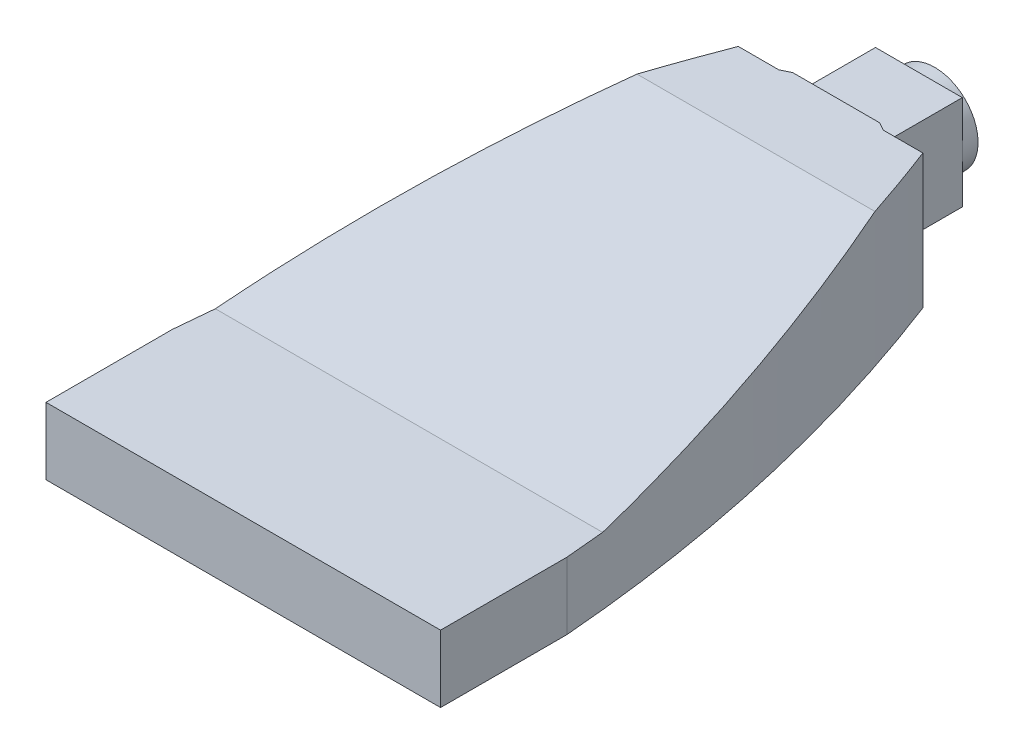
ISO-10303-21;
HEADER;
FILE_DESCRIPTION(('STEP AP214'),'2;1');
FILE_NAME('part.step','',(''),(''),'','','');
FILE_SCHEMA(('AUTOMOTIVE_DESIGN { 1 0 10303 214 1 1 1 1 }'));
ENDSEC;
DATA;
#1=APPLICATION_CONTEXT('core data for automotive mechanical design processes');
#2=APPLICATION_PROTOCOL_DEFINITION('international standard','automotive_design',2000,#1);
#3=PRODUCT_CONTEXT('',#1,'mechanical');
#4=PRODUCT('Part','Part','',(#3));
#5=PRODUCT_RELATED_PRODUCT_CATEGORY('part','',(#4));
#6=PRODUCT_DEFINITION_FORMATION('','',#4);
#7=PRODUCT_DEFINITION_CONTEXT('part definition',#1,'design');
#8=PRODUCT_DEFINITION('design','',#6,#7);
#9=PRODUCT_DEFINITION_SHAPE('','',#8);
#10=(LENGTH_UNIT() NAMED_UNIT(*) SI_UNIT(.MILLI.,.METRE.));
#11=(NAMED_UNIT(*) PLANE_ANGLE_UNIT() SI_UNIT($,.RADIAN.));
#12=(NAMED_UNIT(*) SI_UNIT($,.STERADIAN.) SOLID_ANGLE_UNIT());
#13=UNCERTAINTY_MEASURE_WITH_UNIT(LENGTH_MEASURE(1.E-05),#10,'distance_accuracy_value','');
#14=(GEOMETRIC_REPRESENTATION_CONTEXT(3) GLOBAL_UNCERTAINTY_ASSIGNED_CONTEXT((#13)) GLOBAL_UNIT_ASSIGNED_CONTEXT((#10,
#11,#12)) REPRESENTATION_CONTEXT('',''));
#15=CARTESIAN_POINT('',(0.,0.,0.));
#16=DIRECTION('',(0.,0.,1.));
#17=DIRECTION('',(1.,0.,0.));
#18=AXIS2_PLACEMENT_3D('',#15,#16,#17);
#19=CARTESIAN_POINT('',(0.,17.,-61.559315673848));
#20=DIRECTION('',(0.,0.,1.));
#21=DIRECTION('',(1.,0.,0.));
#22=AXIS2_PLACEMENT_3D('',#19,#20,#21);
#23=PLANE('',#22);
#24=CARTESIAN_POINT('',(-0.384535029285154,8.57674872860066,-61.559315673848));
#25=DIRECTION('',(0.,0.,-1.));
#26=DIRECTION('',(-1.,0.,0.));
#27=AXIS2_PLACEMENT_3D('',#24,#25,#26);
#28=CIRCLE('',#27,5.5);
#29=CARTESIAN_POINT('',(-5.88453502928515,8.57674872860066,-61.559315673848));
#30=VERTEX_POINT('',#29);
#31=CARTESIAN_POINT('',(5.11546497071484,8.57674872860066,-61.559315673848));
#32=VERTEX_POINT('',#31);
#33=EDGE_CURVE('E46',#30,#32,#28,.T.);
#34=ORIENTED_EDGE('',*,*,#33,.F.);
#35=DIRECTION('',(0.,-1.,0.));
#36=VECTOR('',#35,1.);
#37=CARTESIAN_POINT('',(-5.88453502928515,17.,-61.559315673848));
#38=LINE('',#37,#36);
#39=CARTESIAN_POINT('',(-5.88453502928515,14.5,-61.559315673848));
#40=VERTEX_POINT('',#39);
#41=EDGE_CURVE('E158',#40,#30,#38,.T.);
#42=ORIENTED_EDGE('',*,*,#41,.F.);
#43=DIRECTION('',(-1.,0.,0.));
#44=VECTOR('',#43,1.);
#45=CARTESIAN_POINT('',(5.11546497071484,14.5,-61.559315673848));
#46=LINE('',#45,#44);
#47=CARTESIAN_POINT('',(5.11546497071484,14.5,-61.559315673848));
#48=VERTEX_POINT('',#47);
#49=EDGE_CURVE('E641',#48,#40,#46,.T.);
#50=ORIENTED_EDGE('',*,*,#49,.F.);
#51=DIRECTION('',(0.,-1.,0.));
#52=VECTOR('',#51,1.);
#53=CARTESIAN_POINT('',(5.11546497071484,17.,-61.559315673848));
#54=LINE('',#53,#52);
#55=EDGE_CURVE('E179',#48,#32,#54,.T.);
#56=ORIENTED_EDGE('',*,*,#55,.T.);
#57=EDGE_LOOP('',(#34,#42,#50,#56));
#58=FACE_BOUND('',#57,.T.);
#59=ADVANCED_FACE('F35',(#58),#23,.F.);
#60=EDGE_CURVE('E11',#32,#30,#28,.T.);
#61=ORIENTED_EDGE('',*,*,#60,.F.);
#62=CARTESIAN_POINT('',(5.11546497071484,2.5,-61.559315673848));
#63=VERTEX_POINT('',#62);
#64=EDGE_CURVE('E169',#32,#63,#54,.T.);
#65=ORIENTED_EDGE('',*,*,#64,.T.);
#66=DIRECTION('',(-1.,0.,0.));
#67=VECTOR('',#66,1.);
#68=CARTESIAN_POINT('',(5.11546497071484,2.5,-61.559315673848));
#69=LINE('',#68,#67);
#70=CARTESIAN_POINT('',(-5.88453502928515,2.5,-61.559315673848));
#71=VERTEX_POINT('',#70);
#72=EDGE_CURVE('E174',#63,#71,#69,.T.);
#73=ORIENTED_EDGE('',*,*,#72,.T.);
#74=EDGE_CURVE('E162',#30,#71,#38,.T.);
#75=ORIENTED_EDGE('',*,*,#74,.F.);
#76=EDGE_LOOP('',(#61,#65,#73,#75));
#77=FACE_BOUND('',#76,.T.);
#78=ADVANCED_FACE('F172',(#77),#23,.F.);
#79=CARTESIAN_POINT('',(0.,17.,-50.4823249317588));
#80=DIRECTION('',(0.,0.,-1.));
#81=DIRECTION('',(-1.,0.,0.));
#82=AXIS2_PLACEMENT_3D('',#79,#80,#81);
#83=PLANE('',#82);
#84=DIRECTION('',(0.,-1.,0.));
#85=VECTOR('',#84,1.);
#86=CARTESIAN_POINT('',(6.19638247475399,17.,-50.4823249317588));
#87=LINE('',#86,#85);
#88=CARTESIAN_POINT('',(6.19638247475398,17.,-50.4823249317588));
#89=VERTEX_POINT('',#88);
#90=CARTESIAN_POINT('',(6.19638247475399,0.,-50.4823249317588));
#91=VERTEX_POINT('',#90);
#92=EDGE_CURVE('E231',#89,#91,#87,.T.);
#93=ORIENTED_EDGE('',*,*,#92,.F.);
#94=DIRECTION('',(-1.,0.,0.));
#95=VECTOR('',#94,1.);
#96=CARTESIAN_POINT('',(0.,17.,-50.4823249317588));
#97=LINE('',#96,#95);
#98=CARTESIAN_POINT('',(11.1947023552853,17.,-50.4823249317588));
#99=VERTEX_POINT('',#98);
#100=EDGE_CURVE('E292',#99,#89,#97,.T.);
#101=ORIENTED_EDGE('',*,*,#100,.F.);
#102=DIRECTION('',(0.,-1.,0.));
#103=VECTOR('',#102,1.);
#104=CARTESIAN_POINT('',(11.1947023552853,17.,-50.4823249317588));
#105=LINE('',#104,#103);
#106=CARTESIAN_POINT('',(11.1947023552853,0.,-50.4823249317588));
#107=VERTEX_POINT('',#106);
#108=EDGE_CURVE('E59',#99,#107,#105,.T.);
#109=ORIENTED_EDGE('',*,*,#108,.T.);
#110=DIRECTION('',(1.,0.,0.));
#111=VECTOR('',#110,1.);
#112=CARTESIAN_POINT('',(0.,0.,-50.4823249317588));
#113=LINE('',#112,#111);
#114=EDGE_CURVE('E363',#91,#107,#113,.T.);
#115=ORIENTED_EDGE('',*,*,#114,.F.);
#116=EDGE_LOOP('',(#93,#101,#109,#115));
#117=FACE_BOUND('',#116,.T.);
#118=ADVANCED_FACE('F37',(#117),#83,.T.);
#119=CARTESIAN_POINT('',(22.3457359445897,17.,-41.8618451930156));
#120=DIRECTION('',(0.470906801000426,0.,-0.882182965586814));
#121=DIRECTION('',(-0.882182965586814,0.,-0.470906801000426));
#122=AXIS2_PLACEMENT_3D('',#119,#120,#121);
#123=PLANE('',#122);
#124=DIRECTION('',(0.,-1.,0.));
#125=VECTOR('',#124,1.);
#126=CARTESIAN_POINT('',(5.11546497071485,17.,-51.059315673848));
#127=LINE('',#126,#125);
#128=CARTESIAN_POINT('',(5.11546497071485,17.,-51.059315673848));
#129=VERTEX_POINT('',#128);
#130=CARTESIAN_POINT('',(5.11546497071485,14.5,-51.059315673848));
#131=VERTEX_POINT('',#130);
#132=EDGE_CURVE('E223',#129,#131,#127,.T.);
#133=ORIENTED_EDGE('',*,*,#132,.F.);
#134=DIRECTION('',(-0.882182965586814,0.,-0.470906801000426));
#135=VECTOR('',#134,1.);
#136=CARTESIAN_POINT('',(22.3457359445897,17.,-41.8618451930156));
#137=LINE('',#136,#135);
#138=EDGE_CURVE('E225',#89,#129,#137,.T.);
#139=ORIENTED_EDGE('',*,*,#138,.F.);
#140=ORIENTED_EDGE('',*,*,#92,.T.);
#141=DIRECTION('',(0.882182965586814,0.,0.470906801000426));
#142=VECTOR('',#141,1.);
#143=CARTESIAN_POINT('',(22.3457359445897,0.,-41.8618451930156));
#144=LINE('',#143,#142);
#145=CARTESIAN_POINT('',(5.11546497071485,0.,-51.059315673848));
#146=VERTEX_POINT('',#145);
#147=EDGE_CURVE('E359',#146,#91,#144,.T.);
#148=ORIENTED_EDGE('',*,*,#147,.F.);
#149=DIRECTION('',(0.,1.,0.));
#150=VECTOR('',#149,1.);
#151=CARTESIAN_POINT('',(5.11546497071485,0.,-51.059315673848));
#152=LINE('',#151,#150);
#153=CARTESIAN_POINT('',(5.11546497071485,2.5,-51.059315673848));
#154=VERTEX_POINT('',#153);
#155=EDGE_CURVE('E281',#146,#154,#152,.T.);
#156=ORIENTED_EDGE('',*,*,#155,.T.);
#157=EDGE_CURVE('E228',#131,#154,#127,.T.);
#158=ORIENTED_EDGE('',*,*,#157,.F.);
#159=EDGE_LOOP('',(#133,#139,#140,#148,#156,#158));
#160=FACE_BOUND('',#159,.T.);
#161=ADVANCED_FACE('F210',(#160),#123,.T.);
#162=CARTESIAN_POINT('',(5.11546497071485,17.,0.));
#163=DIRECTION('',(-1.,0.,0.));
#164=DIRECTION('',(0.,0.,1.));
#165=AXIS2_PLACEMENT_3D('',#162,#163,#164);
#166=PLANE('',#165);
#167=ORIENTED_EDGE('',*,*,#55,.F.);
#168=DIRECTION('',(0.,0.,1.));
#169=VECTOR('',#168,1.);
#170=CARTESIAN_POINT('',(5.11546497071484,14.5,-61.559315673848));
#171=LINE('',#170,#169);
#172=EDGE_CURVE('E646',#48,#131,#171,.T.);
#173=ORIENTED_EDGE('',*,*,#172,.T.);
#174=ORIENTED_EDGE('',*,*,#157,.T.);
#175=DIRECTION('',(0.,0.,-1.));
#176=VECTOR('',#175,1.);
#177=CARTESIAN_POINT('',(5.11546497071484,2.5,-61.559315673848));
#178=LINE('',#177,#176);
#179=EDGE_CURVE('E273',#154,#63,#178,.T.);
#180=ORIENTED_EDGE('',*,*,#179,.T.);
#181=ORIENTED_EDGE('',*,*,#64,.F.);
#182=EDGE_LOOP('',(#167,#173,#174,#180,#181));
#183=FACE_BOUND('',#182,.T.);
#184=ADVANCED_FACE('F208',(#183),#166,.F.);
#185=CARTESIAN_POINT('',(-5.88453502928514,17.,0.));
#186=DIRECTION('',(1.,0.,0.));
#187=DIRECTION('',(0.,0.,-1.));
#188=AXIS2_PLACEMENT_3D('',#185,#186,#187);
#189=PLANE('',#188);
#190=DIRECTION('',(0.,-1.,0.));
#191=VECTOR('',#190,1.);
#192=CARTESIAN_POINT('',(-5.88453502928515,17.,-51.059315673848));
#193=LINE('',#192,#191);
#194=CARTESIAN_POINT('',(-5.88453502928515,14.5,-51.059315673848));
#195=VERTEX_POINT('',#194);
#196=CARTESIAN_POINT('',(-5.88453502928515,2.5,-51.059315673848));
#197=VERTEX_POINT('',#196);
#198=EDGE_CURVE('E255',#195,#197,#193,.T.);
#199=ORIENTED_EDGE('',*,*,#198,.F.);
#200=DIRECTION('',(0.,0.,1.));
#201=VECTOR('',#200,1.);
#202=CARTESIAN_POINT('',(-5.88453502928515,14.5,-61.559315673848));
#203=LINE('',#202,#201);
#204=EDGE_CURVE('E165',#40,#195,#203,.T.);
#205=ORIENTED_EDGE('',*,*,#204,.F.);
#206=ORIENTED_EDGE('',*,*,#41,.T.);
#207=ORIENTED_EDGE('',*,*,#74,.T.);
#208=DIRECTION('',(0.,0.,-1.));
#209=VECTOR('',#208,1.);
#210=CARTESIAN_POINT('',(-5.88453502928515,2.5,-61.559315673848));
#211=LINE('',#210,#209);
#212=EDGE_CURVE('E271',#197,#71,#211,.T.);
#213=ORIENTED_EDGE('',*,*,#212,.F.);
#214=EDGE_LOOP('',(#199,#205,#206,#207,#213));
#215=FACE_BOUND('',#214,.T.);
#216=ADVANCED_FACE('F160',(#215),#189,.F.);
#217=CARTESIAN_POINT('',(-21.3866147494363,17.,-43.4245292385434));
#218=DIRECTION('',(0.441823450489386,0.,0.897102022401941));
#219=DIRECTION('',(0.897102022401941,0.,-0.441823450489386));
#220=AXIS2_PLACEMENT_3D('',#217,#218,#219);
#221=PLANE('',#220);
#222=DIRECTION('',(-0.897102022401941,0.,0.441823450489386));
#223=VECTOR('',#222,1.);
#224=CARTESIAN_POINT('',(-21.3866147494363,17.,-43.4245292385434));
#225=LINE('',#224,#223);
#226=CARTESIAN_POINT('',(-5.88453502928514,17.,-51.059315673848));
#227=VERTEX_POINT('',#226);
#228=CARTESIAN_POINT('',(-7.05608796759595,17.,-50.4823249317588));
#229=VERTEX_POINT('',#228);
#230=EDGE_CURVE('E298',#227,#229,#225,.T.);
#231=ORIENTED_EDGE('',*,*,#230,.F.);
#232=EDGE_CURVE('E175',#227,#195,#193,.T.);
#233=ORIENTED_EDGE('',*,*,#232,.T.);
#234=ORIENTED_EDGE('',*,*,#198,.T.);
#235=DIRECTION('',(0.,1.,0.));
#236=VECTOR('',#235,1.);
#237=CARTESIAN_POINT('',(-5.88453502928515,0.,-51.059315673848));
#238=LINE('',#237,#236);
#239=CARTESIAN_POINT('',(-5.88453502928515,0.,-51.059315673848));
#240=VERTEX_POINT('',#239);
#241=EDGE_CURVE('E264',#240,#197,#238,.T.);
#242=ORIENTED_EDGE('',*,*,#241,.F.);
#243=DIRECTION('',(-0.897102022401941,0.,0.441823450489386));
#244=VECTOR('',#243,1.);
#245=CARTESIAN_POINT('',(-21.3866147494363,0.,-43.4245292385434));
#246=LINE('',#245,#244);
#247=CARTESIAN_POINT('',(-7.05608796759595,0.,-50.4823249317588));
#248=VERTEX_POINT('',#247);
#249=EDGE_CURVE('E352',#240,#248,#246,.T.);
#250=ORIENTED_EDGE('',*,*,#249,.T.);
#251=DIRECTION('',(0.,-1.,0.));
#252=VECTOR('',#251,1.);
#253=CARTESIAN_POINT('',(-7.05608796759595,17.,-50.4823249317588));
#254=LINE('',#253,#252);
#255=EDGE_CURVE('E246',#229,#248,#254,.T.);
#256=ORIENTED_EDGE('',*,*,#255,.F.);
#257=EDGE_LOOP('',(#231,#233,#234,#242,#250,#256));
#258=FACE_BOUND('',#257,.T.);
#259=ADVANCED_FACE('F261',(#258),#221,.F.);
#260=CARTESIAN_POINT('',(0.,17.,-50.4823249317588));
#261=DIRECTION('',(0.,0.,-1.));
#262=DIRECTION('',(-1.,0.,0.));
#263=AXIS2_PLACEMENT_3D('',#260,#261,#262);
#264=PLANE('',#263);
#265=DIRECTION('',(0.,-1.,0.));
#266=VECTOR('',#265,1.);
#267=CARTESIAN_POINT('',(-12.1947023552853,17.,-50.4823249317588));
#268=LINE('',#267,#266);
#269=CARTESIAN_POINT('',(-12.1947023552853,17.,-50.4823249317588));
#270=VERTEX_POINT('',#269);
#271=CARTESIAN_POINT('',(-12.1947023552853,0.,-50.4823249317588));
#272=VERTEX_POINT('',#271);
#273=EDGE_CURVE('E240',#270,#272,#268,.T.);
#274=ORIENTED_EDGE('',*,*,#273,.F.);
#275=DIRECTION('',(-1.,0.,0.));
#276=VECTOR('',#275,1.);
#277=CARTESIAN_POINT('',(0.,17.,-50.4823249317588));
#278=LINE('',#277,#276);
#279=EDGE_CURVE('E300',#229,#270,#278,.T.);
#280=ORIENTED_EDGE('',*,*,#279,.F.);
#281=ORIENTED_EDGE('',*,*,#255,.T.);
#282=DIRECTION('',(1.,0.,0.));
#283=VECTOR('',#282,1.);
#284=CARTESIAN_POINT('',(0.,0.,-50.4823249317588));
#285=LINE('',#284,#283);
#286=EDGE_CURVE('E357',#272,#248,#285,.T.);
#287=ORIENTED_EDGE('',*,*,#286,.F.);
#288=EDGE_LOOP('',(#274,#280,#281,#287));
#289=FACE_BOUND('',#288,.T.);
#290=ADVANCED_FACE('F442',(#289),#264,.T.);
#291=CARTESIAN_POINT('',(-25.5,17.,7.94068432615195));
#292=CARTESIAN_POINT('',(-23.0650337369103,17.,-22.2267649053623));
#293=CARTESIAN_POINT('',(-12.1947023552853,17.,-50.4823249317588));
#294=B_SPLINE_CURVE_WITH_KNOTS('',2,(#291,#292,#293),.UNSPECIFIED.,.F.,.F.,(3,3),(0.,1.),.UNSPECIFIED.);
#295=DIRECTION('',(0.,-1.,0.));
#296=VECTOR('',#295,1.);
#297=SURFACE_OF_LINEAR_EXTRUSION('',#294,#296);
#298=CARTESIAN_POINT('',(-15.5783973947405,17.0000000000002,-41.0270976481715));
#299=CARTESIAN_POINT('',(-16.1669456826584,16.6566007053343,-39.2507713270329));
#300=CARTESIAN_POINT('',(-16.7316785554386,16.3117296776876,-37.4668320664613));
#301=CARTESIAN_POINT('',(-17.8129404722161,15.6192746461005,-33.884919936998));
#302=CARTESIAN_POINT('',(-18.3294693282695,15.2716906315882,-32.0869470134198));
#303=CARTESIAN_POINT('',(-19.3123640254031,14.5750220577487,-28.4832391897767));
#304=CARTESIAN_POINT('',(-19.7788666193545,14.2259444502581,-26.677540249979));
#305=CARTESIAN_POINT('',(-20.6629592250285,13.5255659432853,-23.0546417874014));
#306=CARTESIAN_POINT('',(-21.0805493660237,13.1742650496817,-21.2374422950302));
#307=CARTESIAN_POINT('',(-21.871018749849,12.465673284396,-17.5720585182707));
#308=CARTESIAN_POINT('',(-22.2433345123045,12.1083597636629,-15.7237570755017));
#309=CARTESIAN_POINT('',(-22.9375165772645,11.3919698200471,-12.0180350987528));
#310=CARTESIAN_POINT('',(-23.2593825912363,11.0328933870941,-10.1606145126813));
#311=CARTESIAN_POINT('',(-23.8535066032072,10.3122178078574,-6.43272391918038));
#312=CARTESIAN_POINT('',(-24.125620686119,9.95061438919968,-4.56223181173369));
#313=CARTESIAN_POINT('',(-24.6192870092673,9.22617008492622,-0.814846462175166));
#314=CARTESIAN_POINT('',(-24.8408398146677,8.8633292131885,1.06204670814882));
#315=CARTESIAN_POINT('',(-25.0372044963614,8.5,2.94146595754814));
#316=B_SPLINE_CURVE_WITH_KNOTS('',3,(#298,#299,#300,#301,#302,#303,#304,#305,#306,#307,#308,
#309,#310,#311,#312,#313,#314,#315),.UNSPECIFIED.,.F.,.F.,(4,2,2,2,2,2,2,2,4),(0.,
5.70745607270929,11.4149343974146,17.1063900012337,22.797830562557,28.5541017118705,
34.3104057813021,40.0831061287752,45.8557419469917),.UNSPECIFIED.);
#317=CARTESIAN_POINT('',(-15.5783973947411,17.,-41.0270976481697));
#318=VERTEX_POINT('',#317);
#319=CARTESIAN_POINT('',(-25.0372044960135,8.5,2.94146595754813));
#320=VERTEX_POINT('',#319);
#321=EDGE_CURVE('E319',#318,#320,#316,.T.);
#322=ORIENTED_EDGE('',*,*,#321,.F.);
#323=CARTESIAN_POINT('',(-12.1947023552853,17.,-50.4823249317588));
#324=CARTESIAN_POINT('',(-23.0650337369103,17.,-22.2267649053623));
#325=CARTESIAN_POINT('',(-25.5,17.,7.94068432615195));
#326=B_SPLINE_CURVE_WITH_KNOTS('',2,(#323,#324,#325),.UNSPECIFIED.,.F.,.F.,(3,3),(0.,1.),.UNSPECIFIED.);
#327=EDGE_CURVE('E248',#270,#318,#326,.T.);
#328=ORIENTED_EDGE('',*,*,#327,.F.);
#329=ORIENTED_EDGE('',*,*,#273,.T.);
#330=CARTESIAN_POINT('',(-25.5,0.,7.94068432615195));
#331=CARTESIAN_POINT('',(-23.0650337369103,0.,-22.2267649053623));
#332=CARTESIAN_POINT('',(-12.1947023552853,0.,-50.4823249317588));
#333=B_SPLINE_CURVE_WITH_KNOTS('',2,(#330,#331,#332),.UNSPECIFIED.,.F.,.F.,(3,3),(0.,1.),.UNSPECIFIED.);
#334=CARTESIAN_POINT('',(-25.5,0.,7.94068432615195));
#335=VERTEX_POINT('',#334);
#336=EDGE_CURVE('E361',#335,#272,#333,.T.);
#337=ORIENTED_EDGE('',*,*,#336,.F.);
#338=DIRECTION('',(0.,-1.,0.));
#339=VECTOR('',#338,1.);
#340=CARTESIAN_POINT('',(-25.5,17.,7.94068432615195));
#341=LINE('',#340,#339);
#342=CARTESIAN_POINT('',(-25.5,8.5,7.94068432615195));
#343=VERTEX_POINT('',#342);
#344=EDGE_CURVE('E247',#343,#335,#341,.T.);
#345=ORIENTED_EDGE('',*,*,#344,.F.);
#346=CARTESIAN_POINT('',(-25.5,8.5,7.94068432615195));
#347=CARTESIAN_POINT('',(-23.0650337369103,8.5,-22.2267649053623));
#348=CARTESIAN_POINT('',(-12.1947023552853,8.5,-50.4823249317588));
#349=B_SPLINE_CURVE_WITH_KNOTS('',2,(#346,#347,#348),.UNSPECIFIED.,.F.,.F.,(3,3),(0.,1.),.UNSPECIFIED.);
#350=EDGE_CURVE('E420',#320,#343,#349,.F.);
#351=ORIENTED_EDGE('',*,*,#350,.F.);
#352=EDGE_LOOP('',(#322,#328,#329,#337,#345,#351));
#353=FACE_BOUND('',#352,.T.);
#354=ADVANCED_FACE('F408',(#353),#297,.T.);
#355=CARTESIAN_POINT('',(24.5,17.,7.94068432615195));
#356=CARTESIAN_POINT('',(22.0650337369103,17.,-22.2267649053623));
#357=CARTESIAN_POINT('',(11.1947023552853,17.,-50.4823249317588));
#358=B_SPLINE_CURVE_WITH_KNOTS('',2,(#355,#356,#357),.UNSPECIFIED.,.F.,.F.,(3,3),(0.,1.),.UNSPECIFIED.);
#359=DIRECTION('',(0.,-1.,0.));
#360=VECTOR('',#359,1.);
#361=SURFACE_OF_LINEAR_EXTRUSION('',#358,#360);
#362=CARTESIAN_POINT('',(24.5,17.,7.94068432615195));
#363=CARTESIAN_POINT('',(22.0650337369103,17.,-22.2267649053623));
#364=CARTESIAN_POINT('',(11.1947023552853,17.,-50.4823249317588));
#365=B_SPLINE_CURVE_WITH_KNOTS('',2,(#362,#363,#364),.UNSPECIFIED.,.F.,.F.,(3,3),(0.,1.),.UNSPECIFIED.);
#366=CARTESIAN_POINT('',(14.5783973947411,17.,-41.0270976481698));
#367=VERTEX_POINT('',#366);
#368=EDGE_CURVE('E286',#367,#99,#365,.T.);
#369=ORIENTED_EDGE('',*,*,#368,.F.);
#370=CARTESIAN_POINT('',(14.5783973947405,17.0000000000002,-41.0270976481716));
#371=CARTESIAN_POINT('',(15.1669456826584,16.6566007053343,-39.2507713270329));
#372=CARTESIAN_POINT('',(15.7316785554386,16.3117296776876,-37.4668320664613));
#373=CARTESIAN_POINT('',(16.8129404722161,15.6192746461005,-33.8849199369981));
#374=CARTESIAN_POINT('',(17.3294693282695,15.2716906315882,-32.0869470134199));
#375=CARTESIAN_POINT('',(18.3123640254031,14.5750220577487,-28.4832391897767));
#376=CARTESIAN_POINT('',(18.7788666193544,14.2259444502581,-26.677540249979));
#377=CARTESIAN_POINT('',(19.6629592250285,13.5255659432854,-23.0546417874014));
#378=CARTESIAN_POINT('',(20.0805493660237,13.1742650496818,-21.2374422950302));
#379=CARTESIAN_POINT('',(20.871018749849,12.465673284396,-17.5720585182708));
#380=CARTESIAN_POINT('',(21.2433345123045,12.1083597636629,-15.7237570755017));
#381=CARTESIAN_POINT('',(21.9375165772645,11.3919698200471,-12.0180350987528));
#382=CARTESIAN_POINT('',(22.2593825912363,11.0328933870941,-10.1606145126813));
#383=CARTESIAN_POINT('',(22.8535066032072,10.3122178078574,-6.43272391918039));
#384=CARTESIAN_POINT('',(23.125620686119,9.95061438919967,-4.56223181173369));
#385=CARTESIAN_POINT('',(23.6192870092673,9.22617008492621,-0.814846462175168));
#386=CARTESIAN_POINT('',(23.8408398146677,8.8633292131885,1.06204670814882));
#387=CARTESIAN_POINT('',(24.0372044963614,8.49999999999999,2.94146595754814));
#388=B_SPLINE_CURVE_WITH_KNOTS('',3,(#370,#371,#372,#373,#374,#375,#376,#377,#378,#379,#380,
#381,#382,#383,#384,#385,#386,#387),.UNSPECIFIED.,.F.,.F.,(4,2,2,2,2,2,2,2,4),(0.,
5.70745607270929,11.4149343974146,17.1063900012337,22.797830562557,28.5541017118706,
34.3104057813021,40.0831061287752,45.8557419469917),.UNSPECIFIED.);
#389=CARTESIAN_POINT('',(24.0372044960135,8.5,2.94146595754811));
#390=VERTEX_POINT('',#389);
#391=EDGE_CURVE('E310',#367,#390,#388,.T.);
#392=ORIENTED_EDGE('',*,*,#391,.T.);
#393=CARTESIAN_POINT('',(24.5,8.5,7.94068432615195));
#394=CARTESIAN_POINT('',(22.0650337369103,8.5,-22.2267649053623));
#395=CARTESIAN_POINT('',(11.1947023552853,8.5,-50.4823249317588));
#396=B_SPLINE_CURVE_WITH_KNOTS('',2,(#393,#394,#395),.UNSPECIFIED.,.F.,.F.,(3,3),(0.,1.),.UNSPECIFIED.);
#397=CARTESIAN_POINT('',(24.5,8.5,7.94068432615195));
#398=VERTEX_POINT('',#397);
#399=EDGE_CURVE('E44',#390,#398,#396,.F.);
#400=ORIENTED_EDGE('',*,*,#399,.T.);
#401=DIRECTION('',(0.,-1.,0.));
#402=VECTOR('',#401,1.);
#403=CARTESIAN_POINT('',(24.5,17.,7.94068432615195));
#404=LINE('',#403,#402);
#405=CARTESIAN_POINT('',(24.5,0.,7.94068432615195));
#406=VERTEX_POINT('',#405);
#407=EDGE_CURVE('E390',#398,#406,#404,.T.);
#408=ORIENTED_EDGE('',*,*,#407,.T.);
#409=CARTESIAN_POINT('',(24.5,0.,7.94068432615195));
#410=CARTESIAN_POINT('',(22.0650337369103,0.,-22.2267649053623));
#411=CARTESIAN_POINT('',(11.1947023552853,0.,-50.4823249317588));
#412=B_SPLINE_CURVE_WITH_KNOTS('',2,(#409,#410,#411),.UNSPECIFIED.,.F.,.F.,(3,3),(0.,1.),.UNSPECIFIED.);
#413=EDGE_CURVE('E382',#406,#107,#412,.T.);
#414=ORIENTED_EDGE('',*,*,#413,.T.);
#415=ORIENTED_EDGE('',*,*,#108,.F.);
#416=EDGE_LOOP('',(#369,#392,#400,#408,#414,#415));
#417=FACE_BOUND('',#416,.T.);
#418=ADVANCED_FACE('F325',(#417),#361,.F.);
#419=CARTESIAN_POINT('',(-25.5,17.,0.));
#420=DIRECTION('',(-1.,0.,0.));
#421=DIRECTION('',(0.,0.,1.));
#422=AXIS2_PLACEMENT_3D('',#419,#420,#421);
#423=PLANE('',#422);
#424=DIRECTION('',(0.,0.,1.));
#425=VECTOR('',#424,1.);
#426=CARTESIAN_POINT('',(-25.5,8.5,0.));
#427=LINE('',#426,#425);
#428=CARTESIAN_POINT('',(-25.5,8.5,23.940684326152));
#429=VERTEX_POINT('',#428);
#430=EDGE_CURVE('E404',#343,#429,#427,.T.);
#431=ORIENTED_EDGE('',*,*,#430,.F.);
#432=ORIENTED_EDGE('',*,*,#344,.T.);
#433=DIRECTION('',(0.,0.,-1.));
#434=VECTOR('',#433,1.);
#435=CARTESIAN_POINT('',(-25.5,0.,0.));
#436=LINE('',#435,#434);
#437=CARTESIAN_POINT('',(-25.5,0.,23.940684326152));
#438=VERTEX_POINT('',#437);
#439=EDGE_CURVE('E370',#438,#335,#436,.T.);
#440=ORIENTED_EDGE('',*,*,#439,.F.);
#441=DIRECTION('',(0.,-1.,0.));
#442=VECTOR('',#441,1.);
#443=CARTESIAN_POINT('',(-25.5,17.,23.940684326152));
#444=LINE('',#443,#442);
#445=EDGE_CURVE('E393',#429,#438,#444,.T.);
#446=ORIENTED_EDGE('',*,*,#445,.F.);
#447=EDGE_LOOP('',(#431,#432,#440,#446));
#448=FACE_BOUND('',#447,.T.);
#449=ADVANCED_FACE('F403',(#448),#423,.T.);
#450=CARTESIAN_POINT('',(0.,17.,23.9406843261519));
#451=DIRECTION('',(0.,0.,-1.));
#452=DIRECTION('',(-1.,0.,0.));
#453=AXIS2_PLACEMENT_3D('',#450,#451,#452);
#454=PLANE('',#453);
#455=DIRECTION('',(0.,-1.,0.));
#456=VECTOR('',#455,1.);
#457=CARTESIAN_POINT('',(24.5,17.,23.9406843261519));
#458=LINE('',#457,#456);
#459=CARTESIAN_POINT('',(24.5,8.5,23.9406843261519));
#460=VERTEX_POINT('',#459);
#461=CARTESIAN_POINT('',(24.5,0.,23.9406843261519));
#462=VERTEX_POINT('',#461);
#463=EDGE_CURVE('E392',#460,#462,#458,.T.);
#464=ORIENTED_EDGE('',*,*,#463,.F.);
#465=DIRECTION('',(1.,0.,0.));
#466=VECTOR('',#465,1.);
#467=CARTESIAN_POINT('',(-55.5,8.5,23.940684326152));
#468=LINE('',#467,#466);
#469=EDGE_CURVE('E306',#429,#460,#468,.T.);
#470=ORIENTED_EDGE('',*,*,#469,.F.);
#471=ORIENTED_EDGE('',*,*,#445,.T.);
#472=DIRECTION('',(1.,0.,0.));
#473=VECTOR('',#472,1.);
#474=CARTESIAN_POINT('',(0.,0.,23.9406843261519));
#475=LINE('',#474,#473);
#476=EDGE_CURVE('E376',#438,#462,#475,.T.);
#477=ORIENTED_EDGE('',*,*,#476,.T.);
#478=EDGE_LOOP('',(#464,#470,#471,#477));
#479=FACE_BOUND('',#478,.T.);
#480=ADVANCED_FACE('F349',(#479),#454,.F.);
#481=CARTESIAN_POINT('',(24.5,17.,0.));
#482=DIRECTION('',(-1.,0.,0.));
#483=DIRECTION('',(0.,0.,1.));
#484=AXIS2_PLACEMENT_3D('',#481,#482,#483);
#485=PLANE('',#484);
#486=ORIENTED_EDGE('',*,*,#407,.F.);
#487=DIRECTION('',(0.,0.,-1.));
#488=VECTOR('',#487,1.);
#489=CARTESIAN_POINT('',(24.5,8.5,0.));
#490=LINE('',#489,#488);
#491=EDGE_CURVE('E304',#460,#398,#490,.T.);
#492=ORIENTED_EDGE('',*,*,#491,.F.);
#493=ORIENTED_EDGE('',*,*,#463,.T.);
#494=DIRECTION('',(0.,0.,-1.));
#495=VECTOR('',#494,1.);
#496=CARTESIAN_POINT('',(24.5,0.,0.));
#497=LINE('',#496,#495);
#498=EDGE_CURVE('E379',#462,#406,#497,.T.);
#499=ORIENTED_EDGE('',*,*,#498,.T.);
#500=EDGE_LOOP('',(#486,#492,#493,#499));
#501=FACE_BOUND('',#500,.T.);
#502=ADVANCED_FACE('F341',(#501),#485,.F.);
#503=CARTESIAN_POINT('',(0.,0.,0.));
#504=DIRECTION('',(0.,1.,0.));
#505=DIRECTION('',(0.,0.,1.));
#506=AXIS2_PLACEMENT_3D('',#503,#504,#505);
#507=PLANE('',#506);
#508=ORIENTED_EDGE('',*,*,#249,.F.);
#509=DIRECTION('',(-1.,0.,0.));
#510=VECTOR('',#509,1.);
#511=CARTESIAN_POINT('',(5.11546497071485,0.,-51.059315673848));
#512=LINE('',#511,#510);
#513=EDGE_CURVE('E275',#146,#240,#512,.T.);
#514=ORIENTED_EDGE('',*,*,#513,.F.);
#515=ORIENTED_EDGE('',*,*,#147,.T.);
#516=ORIENTED_EDGE('',*,*,#114,.T.);
#517=ORIENTED_EDGE('',*,*,#413,.F.);
#518=ORIENTED_EDGE('',*,*,#498,.F.);
#519=ORIENTED_EDGE('',*,*,#476,.F.);
#520=ORIENTED_EDGE('',*,*,#439,.T.);
#521=ORIENTED_EDGE('',*,*,#336,.T.);
#522=ORIENTED_EDGE('',*,*,#286,.T.);
#523=EDGE_LOOP('',(#508,#514,#515,#516,#517,#518,#519,#520,#521,#522));
#524=FACE_BOUND('',#523,.T.);
#525=ADVANCED_FACE('F338',(#524),#507,.F.);
#526=CARTESIAN_POINT('',(-55.5,8.5,0.));
#527=DIRECTION('',(0.,-1.,0.));
#528=DIRECTION('',(0.,0.,-1.));
#529=AXIS2_PLACEMENT_3D('',#526,#527,#528);
#530=PLANE('',#529);
#531=ORIENTED_EDGE('',*,*,#350,.T.);
#532=ORIENTED_EDGE('',*,*,#430,.T.);
#533=ORIENTED_EDGE('',*,*,#469,.T.);
#534=ORIENTED_EDGE('',*,*,#491,.T.);
#535=ORIENTED_EDGE('',*,*,#399,.F.);
#536=DIRECTION('',(1.,0.,0.));
#537=VECTOR('',#536,1.);
#538=CARTESIAN_POINT('',(-55.5,8.5,2.94146595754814));
#539=LINE('',#538,#537);
#540=EDGE_CURVE('E307',#320,#390,#539,.T.);
#541=ORIENTED_EDGE('',*,*,#540,.F.);
#542=EDGE_LOOP('',(#531,#532,#533,#534,#535,#541));
#543=FACE_BOUND('',#542,.T.);
#544=ADVANCED_FACE('F335',(#543),#530,.F.);
#545=CARTESIAN_POINT('',(-55.5,8.74193518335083,1.68999036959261));
#546=DIRECTION('',(0.,-0.981821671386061,-0.189805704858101));
#547=DIRECTION('',(0.,0.189805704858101,-0.981821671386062));
#548=AXIS2_PLACEMENT_3D('',#545,#546,#547);
#549=PLANE('',#548);
#550=ORIENTED_EDGE('',*,*,#321,.T.);
#551=ORIENTED_EDGE('',*,*,#540,.T.);
#552=ORIENTED_EDGE('',*,*,#391,.F.);
#553=DIRECTION('',(-1.,0.,0.));
#554=VECTOR('',#553,1.);
#555=CARTESIAN_POINT('',(0.,17.,-41.0270976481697));
#556=LINE('',#555,#554);
#557=EDGE_CURVE('E301',#367,#318,#556,.T.);
#558=ORIENTED_EDGE('',*,*,#557,.T.);
#559=EDGE_LOOP('',(#550,#551,#552,#558));
#560=FACE_BOUND('',#559,.T.);
#561=ADVANCED_FACE('F330',(#560),#549,.F.);
#562=CARTESIAN_POINT('',(0.,17.,0.));
#563=DIRECTION('',(0.,1.,0.));
#564=DIRECTION('',(0.,0.,1.));
#565=AXIS2_PLACEMENT_3D('',#562,#563,#564);
#566=PLANE('',#565);
#567=DIRECTION('',(-1.,0.,0.));
#568=VECTOR('',#567,1.);
#569=CARTESIAN_POINT('',(5.11546497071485,17.,-51.059315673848));
#570=LINE('',#569,#568);
#571=EDGE_CURVE('E279',#129,#227,#570,.T.);
#572=ORIENTED_EDGE('',*,*,#571,.T.);
#573=ORIENTED_EDGE('',*,*,#230,.T.);
#574=ORIENTED_EDGE('',*,*,#279,.T.);
#575=ORIENTED_EDGE('',*,*,#327,.T.);
#576=ORIENTED_EDGE('',*,*,#557,.F.);
#577=ORIENTED_EDGE('',*,*,#368,.T.);
#578=ORIENTED_EDGE('',*,*,#100,.T.);
#579=ORIENTED_EDGE('',*,*,#138,.T.);
#580=EDGE_LOOP('',(#572,#573,#574,#575,#576,#577,#578,#579));
#581=FACE_BOUND('',#580,.T.);
#582=ADVANCED_FACE('F334',(#581),#566,.T.);
#583=CARTESIAN_POINT('',(5.11546497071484,2.5,-61.559315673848));
#584=DIRECTION('',(0.,1.,0.));
#585=DIRECTION('',(0.,0.,1.));
#586=AXIS2_PLACEMENT_3D('',#583,#584,#585);
#587=PLANE('',#586);
#588=ORIENTED_EDGE('',*,*,#212,.T.);
#589=ORIENTED_EDGE('',*,*,#72,.F.);
#590=ORIENTED_EDGE('',*,*,#179,.F.);
#591=DIRECTION('',(-1.,0.,0.));
#592=VECTOR('',#591,1.);
#593=CARTESIAN_POINT('',(5.11546497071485,2.5,-51.059315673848));
#594=LINE('',#593,#592);
#595=EDGE_CURVE('E269',#154,#197,#594,.T.);
#596=ORIENTED_EDGE('',*,*,#595,.T.);
#597=EDGE_LOOP('',(#588,#589,#590,#596));
#598=FACE_BOUND('',#597,.T.);
#599=ADVANCED_FACE('F270',(#598),#587,.F.);
#600=CARTESIAN_POINT('',(5.11546497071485,0.,-51.059315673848));
#601=DIRECTION('',(0.,0.,1.));
#602=DIRECTION('',(0.,-1.,0.));
#603=AXIS2_PLACEMENT_3D('',#600,#601,#602);
#604=PLANE('',#603);
#605=ORIENTED_EDGE('',*,*,#241,.T.);
#606=ORIENTED_EDGE('',*,*,#595,.F.);
#607=ORIENTED_EDGE('',*,*,#155,.F.);
#608=ORIENTED_EDGE('',*,*,#513,.T.);
#609=EDGE_LOOP('',(#605,#606,#607,#608));
#610=FACE_BOUND('',#609,.T.);
#611=ADVANCED_FACE('F277',(#610),#604,.F.);
#612=CARTESIAN_POINT('',(5.11546497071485,17.,-51.059315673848));
#613=DIRECTION('',(0.,0.,1.));
#614=DIRECTION('',(1.,0.,0.));
#615=AXIS2_PLACEMENT_3D('',#612,#613,#614);
#616=PLANE('',#615);
#617=ORIENTED_EDGE('',*,*,#232,.F.);
#618=ORIENTED_EDGE('',*,*,#571,.F.);
#619=ORIENTED_EDGE('',*,*,#132,.T.);
#620=DIRECTION('',(-1.,0.,0.));
#621=VECTOR('',#620,1.);
#622=CARTESIAN_POINT('',(5.11546497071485,14.5,-51.059315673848));
#623=LINE('',#622,#621);
#624=EDGE_CURVE('E633',#131,#195,#623,.T.);
#625=ORIENTED_EDGE('',*,*,#624,.T.);
#626=EDGE_LOOP('',(#617,#618,#619,#625));
#627=FACE_BOUND('',#626,.T.);
#628=ADVANCED_FACE('F194',(#627),#616,.F.);
#629=CARTESIAN_POINT('',(5.11546497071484,14.5,-61.559315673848));
#630=DIRECTION('',(0.,-1.,0.));
#631=DIRECTION('',(0.,0.,-1.));
#632=AXIS2_PLACEMENT_3D('',#629,#630,#631);
#633=PLANE('',#632);
#634=ORIENTED_EDGE('',*,*,#204,.T.);
#635=ORIENTED_EDGE('',*,*,#624,.F.);
#636=ORIENTED_EDGE('',*,*,#172,.F.);
#637=ORIENTED_EDGE('',*,*,#49,.T.);
#638=EDGE_LOOP('',(#634,#635,#636,#637));
#639=FACE_BOUND('',#638,.T.);
#640=ADVANCED_FACE('F185',(#639),#633,.F.);
#641=CARTESIAN_POINT('',(-0.384535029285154,8.57674872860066,-63.559315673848));
#642=DIRECTION('',(0.,0.,1.));
#643=DIRECTION('',(1.,0.,0.));
#644=AXIS2_PLACEMENT_3D('',#641,#642,#643);
#645=CYLINDRICAL_SURFACE('',#644,5.5);
#646=CARTESIAN_POINT('',(-0.384535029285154,8.57674872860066,-63.559315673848));
#647=DIRECTION('',(0.,0.,-1.));
#648=DIRECTION('',(-1.,0.,0.));
#649=AXIS2_PLACEMENT_3D('',#646,#647,#648);
#650=CIRCLE('',#649,5.5);
#651=CARTESIAN_POINT('',(-5.88453502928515,8.57674872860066,-63.559315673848));
#652=VERTEX_POINT('',#651);
#653=EDGE_CURVE('E181',#652,#652,#650,.T.);
#654=ORIENTED_EDGE('',*,*,#653,.F.);
#655=EDGE_LOOP('',(#654));
#656=FACE_BOUND('',#655,.T.);
#657=ORIENTED_EDGE('',*,*,#33,.T.);
#658=ORIENTED_EDGE('',*,*,#60,.T.);
#659=EDGE_LOOP('',(#657,#658));
#660=FACE_BOUND('',#659,.T.);
#661=ADVANCED_FACE('F182',(#656,#660),#645,.T.);
#662=CARTESIAN_POINT('',(-0.384535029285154,8.57674872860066,-63.559315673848));
#663=DIRECTION('',(0.,0.,-1.));
#664=DIRECTION('',(-1.,0.,0.));
#665=AXIS2_PLACEMENT_3D('',#662,#663,#664);
#666=PLANE('',#665);
#667=ORIENTED_EDGE('',*,*,#653,.T.);
#668=EDGE_LOOP('',(#667));
#669=FACE_BOUND('',#668,.T.);
#670=ADVANCED_FACE('F184',(#669),#666,.T.);
#671=CLOSED_SHELL('',(#59,#78,#118,#161,#184,#216,#259,#290,#354,#418,#449,#480,#502,#525,#544,
#561,#582,#599,#611,#628,#640,#661,#670));
#672=MANIFOLD_SOLID_BREP('B2',#671);
#673=ADVANCED_BREP_SHAPE_REPRESENTATION('',(#18,#672),#14);
#674=SHAPE_DEFINITION_REPRESENTATION(#9,#673);
ENDSEC;
END-ISO-10303-21;
